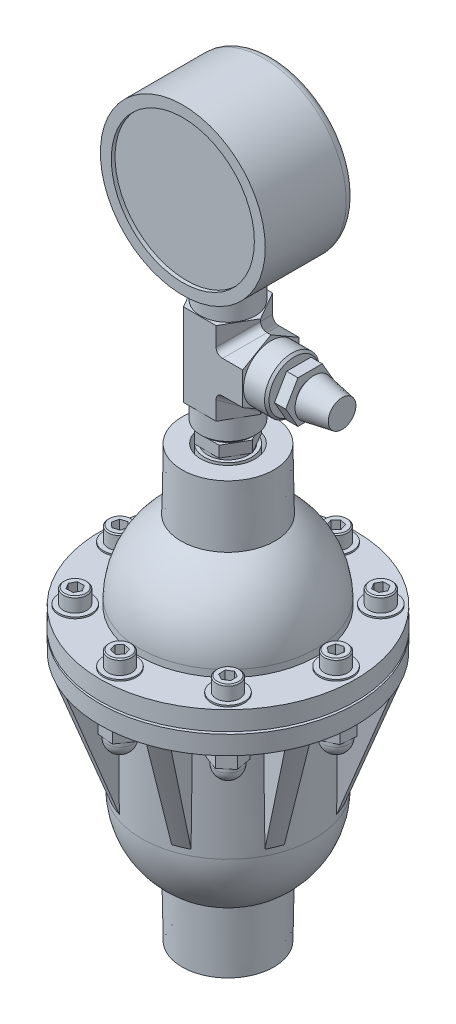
from build123d import *

# Parameters (mm, degrees)
SKETCH1_R                    = 43.2435
EXTRUDE1_DEPTH               = 6.35
EXTRUDE1_TAPER               = 1
SKETCH2_R                    = 29.972
EXTRUDE2_DEPTH               = 37.338
EXTRUDE2_TAPER               = 1
FILLET1_R                    = 29.21
SKETCH3_R                    = 15.494
EXTRUDE3_DEPTH               = 53.6702
EXTRUDE3_DRAFT               = 1
SKETCH4_R                    = 9.144
SKETCH4_R_2                  = 8.001
EXTRUDE4_DEPTH               = 16.637
EXTRUDE4_DRAFT               = -1
SKETCH7_R                    = 43.2435
EXTRUDE5_DEPTH               = 6.35
EXTRUDE5_DRAFT               = -1
SKETCH8_R                    = 32.4866
EXTRUDE6_DEPTH               = 6.35
SKETCH9_R                    = 29.972
EXTRUDE7_DEPTH               = 74.422
EXTRUDE7_DRAFT               = -1
FILLET3_R                    = 28.448
SKETCH14_R                   = 15.494
EXTRUDE9_DEPTH               = 97.917
EXTRUDE9_DRAFT               = -1
EXTRUDE10_DEPTH              = 38.1
EXTRUDE10_DRAFT              = -1
CIRPATTERN1_COPY_1_DEPTH     = 38.1
CIRPATTERN1_COPY_1_DRAFT     = -1
CIRPATTERN1_COPY_2_DEPTH     = 38.1
CIRPATTERN1_COPY_2_DRAFT     = -1
CIRPATTERN1_COPY_3_DEPTH     = 38.1
CIRPATTERN1_COPY_3_DRAFT     = -1
CIRPATTERN1_COPY_4_DEPTH     = 38.1
CIRPATTERN1_COPY_4_DRAFT     = -1
CIRPATTERN1_COPY_5_DEPTH     = 38.1
CIRPATTERN1_COPY_5_DRAFT     = -1
CIRPATTERN1_COPY_6_DEPTH     = 38.1
CIRPATTERN1_COPY_6_DRAFT     = -1
CIRPATTERN1_COPY_7_DEPTH     = 38.1
CIRPATTERN1_COPY_7_DRAFT     = -1
SKETCH19_R                   = 5.5626
EXTRUDE11_DEPTH              = 0.508
SKETCH20_R                   = 3.9624
EXTRUDE12_DEPTH              = 5.334
EXTRUDE13_DEPTH              = 3.175
CHAMFER1_SIZE                = 0.381
EXTRUDE14_START              = -0.508
SKETCH22_R                   = 5.5626
EXTRUDE14_DEPTH              = 0.508
EXTRUDE15_DEPTH              = 5.334
SKETCH24_R                   = 4.318
EXTRUDE16_DEPTH              = 10.922
FILLET4_R                    = 4.191
CIRPATTERN2_COUNT            = 8
CHAMFER1_OF_CIRPATTERN2_SIZE = 0.381
FILLET4_OF_CIRPATTERN2_R     = 4.191
SKETCH25_R                   = 6.858
BOSS_EXTRUDE1_DEPTH          = 132.334
SKETCH26_R                   = 27.813
BOSS_EXTRUDE2_DEPTH          = 15.24
BOSS_EXTRUDE5_DEPTH          = 3.81
SKETCH30_R                   = 9.271
BOSS_EXTRUDE6_DEPTH          = 43.18
BOSS_EXTRUDE8_DEPTH          = 27.94
BOSS_EXTRUDE9_DEPTH          = 14.986
SKETCH33_R                   = 9.271
BOSS_EXTRUDE10_DEPTH         = 14.986
SKETCH34_R                   = 6.858
BOSS_EXTRUDE11_DEPTH         = 3.81
BOSS_EXTRUDE12_DEPTH         = 3.81
SKETCH38_R                   = 4.7625
BOSS_EXTRUDE14_DEPTH         = 9.525
SKETCH39_R                   = 6.35
BOSS_EXTRUDE15_DEPTH         = 9.525
BOSS_EXTRUDE15_TAPER         = 10
SKETCH40_R                   = 24.13
CUT_EXTRUDE1_DEPTH           = 1.27
FILLET5_R                    = 2.54
FILLET6_R                    = 3.175
CHAMFER2_SIZE                = 0.762


with BuildPart() as part:
    # Sketch1 → Extrude1 (new body)
    with BuildSketch(Plane(origin=(0, 0, 0), x_dir=(1, 0, 0), z_dir=(0, 1, 0))):
        Circle(SKETCH1_R)
    extrude(amount=EXTRUDE1_DEPTH, taper=EXTRUDE1_TAPER)

    # Sketch2 → Extrude2 (add)
    with BuildSketch(Plane(origin=(0, 0, 0), x_dir=(1, 0, 0), z_dir=(0, 1, 0))):
        Circle(SKETCH2_R)
    extrude(amount=EXTRUDE2_DEPTH, taper=EXTRUDE2_TAPER)

    # Fillet1
    fillet1_edges = [part.edges().sort_by_distance(p)[0] for p in [
        (-29.320262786, 37.338, 0),
    ]]
    fillet(fillet1_edges, radius=FILLET1_R)


with BuildPart() as extrude3_tool:
    # Sketch3 → Extrude3 (with draft: the straight prism first)
    with BuildSketch(Plane(origin=(0, 53.6702, 0), x_dir=(-1, 0, 0), z_dir=(0, 1, 0))):
        Circle(SKETCH3_R)
    extrude(amount=-EXTRUDE3_DEPTH)
    # Extrude3: the draft: its side faces are tilted about the plane it starts from
    extrude3_sides = [extrude3_tool.faces().sort_by_distance(p)[0] for p in [
        (15.494, 26.8351, 0),
    ]]
    draft(extrude3_sides, Plane(origin=(0, 53.6702, 0), x_dir=(-1, 0, 0), z_dir=(0, 1, 0)), EXTRUDE3_DRAFT)


with BuildPart() as part_1:
    add(part.part)

    # Extrude3: add extrude3_tool
    add(extrude3_tool.part)


with BuildPart() as extrude4_tool:
    # Sketch4 → Extrude4 (with draft: the straight prism first)
    with BuildSketch(Plane(origin=(0, 53.6702, 0), x_dir=(-1, 0, 0), z_dir=(0, 1, 0))):
        Circle(SKETCH4_R)
        Circle(SKETCH4_R_2, mode=Mode.SUBTRACT)
    extrude(amount=-EXTRUDE4_DEPTH)
    # Extrude4: the draft: its side faces are tilted about the plane it starts from
    extrude4_sides = [extrude4_tool.faces().sort_by_distance(p)[0] for p in [
        (9.144, 45.3517, 0),
        (8.001, 45.3517, 0),
    ]]
    draft(extrude4_sides, Plane(origin=(0, 53.6702, 0), x_dir=(-1, 0, 0), z_dir=(0, 1, 0)), EXTRUDE4_DRAFT)


with BuildPart() as part_2:
    add(part_1.part)

    # Extrude4: cut by extrude4_tool
    add(extrude4_tool.part, mode=Mode.SUBTRACT)

    # Sketch5 → 1_4 NPT Tapped Hole1 (revolve, cut)
    with BuildSketch(Plane(origin=(0, 53.6702, 0), x_dir=(0, 0, 1), z_dir=(1, 0, 0))):
        Polygon((0, 0), (0, 20.360347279), (5.5626, 17.018), (5.5626, 9.906), (6.557984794, 9.906), (6.8545837, 0), align=None)
    revolve(axis=Axis((0, 60.0202, 0), (0, -1, 0)), mode=Mode.SUBTRACT)



with BuildPart() as body_2:
    # Sketch7 → Extrude5 (with draft: the straight prism first)
    with BuildSketch(Plane(origin=(0, -0.762, 0), x_dir=(-1, 0, 0), z_dir=(0, 1, 0))):
        Circle(SKETCH7_R)
    extrude(amount=-EXTRUDE5_DEPTH)
    # Extrude5: the draft: its side faces are tilted about the plane it starts from
    extrude5_sides = [body_2.faces().sort_by_distance(p)[0] for p in [
        (43.2435, -3.937, 0),
    ]]
    draft(extrude5_sides, Plane(origin=(0, -0.762, 0), x_dir=(-1, 0, 0), z_dir=(0, 1, 0)), EXTRUDE5_DRAFT)


with BuildPart() as part_3:
    add(part_2.part)

    add(body_2.part)  # Extrude6 merges body 2
    # Sketch8 → Extrude6 (add)
    with BuildSketch(Plane(origin=(0, -0.762, 0), x_dir=(-1, 0, 0), z_dir=(0, 1, 0))):
        with Locations(Location((0, 0, 0), (0, 0, 90))):
            Circle(SKETCH8_R)
    extrude(amount=EXTRUDE6_DEPTH)


with BuildPart() as extrude7_tool:
    # Sketch9 → Extrude7 (with draft: the straight prism first)
    with BuildSketch(Plane(origin=(0, -0.762, 0), x_dir=(-1, 0, 0), z_dir=(0, 1, 0))):
        Circle(SKETCH9_R)
    extrude(amount=-EXTRUDE7_DEPTH)
    # Extrude7: the draft: its side faces are tilted about the plane it starts from
    extrude7_sides = [extrude7_tool.faces().sort_by_distance(p)[0] for p in [
        (29.972, -37.973, 0),
    ]]
    draft(extrude7_sides, Plane(origin=(0, -0.762, 0), x_dir=(-1, 0, 0), z_dir=(0, 1, 0)), EXTRUDE7_DRAFT)


with BuildPart() as part_4:
    add(part_3.part)

    # Extrude7: add extrude7_tool
    add(extrude7_tool.part)

    # Fillet3
    fillet3_edges = [part_4.edges().sort_by_distance(p)[0] for p in [
        (28.672959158, -75.184, 0),
    ]]
    fillet(fillet3_edges, radius=FILLET3_R)


with BuildPart() as extrude9_tool:
    # Sketch14 → Extrude9 (with draft: the straight prism first)
    with BuildSketch(Plane(origin=(0, -91.567, 0), x_dir=(-1, 0, 0), z_dir=(0, 1, 0))):
        Circle(SKETCH14_R)
    extrude(amount=EXTRUDE9_DEPTH)
    # Extrude9: the draft: its side faces are tilted about the plane it starts from
    extrude9_sides = [extrude9_tool.faces().sort_by_distance(p)[0] for p in [
        (15.494, -42.6085, 0),
    ]]
    draft(extrude9_sides, Plane(origin=(0, -91.567, 0), x_dir=(-1, 0, 0), z_dir=(0, 1, 0)), EXTRUDE9_DRAFT)


with BuildPart() as part_5:
    add(part_4.part)

    # Extrude9: add extrude9_tool
    add(extrude9_tool.part)

    # Sketch15 → 1_2 NPT Tapped Hole2 (revolve, cut)
    with BuildSketch(Plane(origin=(0, -91.567, 0), x_dir=(0, 0, -1), z_dir=(1, 0, 0))):
        Polygon((0, 0), (0, 27.970543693), (8.9281, 22.606), (8.9281, 13.462), (10.261665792, 13.462), (10.6647361, 0), align=None)
    revolve(axis=Axis((0, -97.917, 0), (0, 1, 0)), mode=Mode.SUBTRACT)


with BuildPart() as extrude10_tool:
    # Sketch17 → Extrude10 (with draft: the straight prism first)
    with BuildSketch(Plane(origin=(0, -7.112, 0), x_dir=(-1, 0, 0), z_dir=(0, 1, 0))):
        with BuildLine():
            Line((-25.320914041, 7.051670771), (-22.916283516, 12.928830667))
            Line((-22.916283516, 12.928830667), (-38.628934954, 19.437223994))
            ThreePointArc((-38.628934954, 19.437223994), (-39.951784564, 16.548571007), (-41.058974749, 13.570588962))
            Line((-41.058974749, 13.570588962), (-25.320914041, 7.051670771))
        make_face()
    extrude(amount=-EXTRUDE10_DEPTH)
    # Extrude10: the draft: its side faces are tilted about the plane it starts from
    extrude10_sides = [extrude10_tool.faces().sort_by_distance(p)[0] for p in [
        (33.189944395, -26.162, 10.311129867),
        (24.118598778, -26.162, 9.990250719),
        (30.772609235, -26.162, 16.183027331),
        (39.951784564, -26.162, 16.548571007),
    ]]
    draft(extrude10_sides, Plane(origin=(0, -7.112, 0), x_dir=(-1, 0, 0), z_dir=(0, 1, 0)), EXTRUDE10_DRAFT)


with BuildPart() as part_6:
    add(part_5.part)

    # Extrude10: add extrude10_tool
    add(extrude10_tool.part)


with BuildPart() as cirpattern1_copy_1_tool:
    # CirPattern1 copy 1 sketch → CirPattern1 copy 1 (with draft: the straight prism first)
    with BuildSketch(Plane(origin=(0, -7.112, 0), x_dir=(-0.7071067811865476, 0, 0.7071067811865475), z_dir=(0, 1, 0))):
        with BuildLine():
            Line((-25.320914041, 7.051670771), (-22.916283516, 12.928830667))
            Line((-22.916283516, 12.928830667), (-38.628934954, 19.437223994))
            ThreePointArc((-38.628934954, 19.437223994), (-39.951784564, 16.548571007), (-41.058974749, 13.570588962))
            Line((-41.058974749, 13.570588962), (-25.320914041, 7.051670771))
        make_face()
    extrude(amount=-CIRPATTERN1_COPY_1_DEPTH)
    # CirPattern1 copy 1: the draft: its side faces are tilted about the plane it starts from
    cirpattern1_copy_1_sides = [cirpattern1_copy_1_tool.faces().sort_by_distance(p)[0] for p in [
        (30.7599046, -26.162, -16.177764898),
        (24.118598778, -26.162, -9.990250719),
        (33.202649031, -26.162, -10.316392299),
        (39.951784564, -26.162, -16.548571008),
    ]]
    draft(cirpattern1_copy_1_sides, Plane(origin=(0, -7.112, 0), x_dir=(-0.7071067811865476, 0, 0.7071067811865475), z_dir=(0, 1, 0)), CIRPATTERN1_COPY_1_DRAFT)


with BuildPart() as part_7:
    add(part_6.part)

    # CirPattern1 copy 1: add cirpattern1_copy_1_tool
    add(cirpattern1_copy_1_tool.part)


with BuildPart() as cirpattern1_copy_2_tool:
    # CirPattern1 copy 2 sketch → CirPattern1 copy 2 (with draft: the straight prism first)
    with BuildSketch(Plane.ZX.offset(-7.112)):
        with BuildLine():
            Line((-25.320914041, 7.051670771), (-22.916283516, 12.928830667))
            Line((-22.916283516, 12.928830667), (-38.628934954, 19.437223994))
            ThreePointArc((-38.628934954, 19.437223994), (-39.951784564, 16.548571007), (-41.058974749, 13.570588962))
            Line((-41.058974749, 13.570588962), (-25.320914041, 7.051670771))
        make_face()
    extrude(amount=-CIRPATTERN1_COPY_2_DEPTH)
    # CirPattern1 copy 2: the draft: its side faces are tilted about the plane it starts from
    cirpattern1_copy_2_sides = [cirpattern1_copy_2_tool.faces().sort_by_distance(p)[0] for p in [
        (10.311129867, -26.162, -33.189944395),
        (9.990250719, -26.162, -24.118598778),
        (16.183027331, -26.162, -30.772609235),
        (16.548571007, -26.162, -39.951784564),
    ]]
    draft(cirpattern1_copy_2_sides, Plane.ZX.offset(-7.112), CIRPATTERN1_COPY_2_DRAFT)


with BuildPart() as part_8:
    add(part_7.part)

    # CirPattern1 copy 2: add cirpattern1_copy_2_tool
    add(cirpattern1_copy_2_tool.part)


with BuildPart() as cirpattern1_copy_3_tool:
    # CirPattern1 copy 3 sketch → CirPattern1 copy 3 (with draft: the straight prism first)
    with BuildSketch(Plane(origin=(0, -7.112, 0), x_dir=(0.7071067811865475, 0, 0.7071067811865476), z_dir=(0, 1, 0))):
        with BuildLine():
            Line((-25.320914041, 7.051670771), (-22.916283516, 12.928830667))
            Line((-22.916283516, 12.928830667), (-38.628934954, 19.437223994))
            ThreePointArc((-38.628934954, 19.437223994), (-39.951784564, 16.548571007), (-41.058974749, 13.570588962))
            Line((-41.058974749, 13.570588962), (-25.320914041, 7.051670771))
        make_face()
    extrude(amount=-CIRPATTERN1_COPY_3_DEPTH)
    # CirPattern1 copy 3: the draft: its side faces are tilted about the plane it starts from
    cirpattern1_copy_3_sides = [cirpattern1_copy_3_tool.faces().sort_by_distance(p)[0] for p in [
        (-16.177764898, -26.162, -30.7599046),
        (-9.990250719, -26.162, -24.118598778),
        (-10.316392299, -26.162, -33.202649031),
        (-16.548571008, -26.162, -39.951784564),
    ]]
    draft(cirpattern1_copy_3_sides, Plane(origin=(0, -7.112, 0), x_dir=(0.7071067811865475, 0, 0.7071067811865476), z_dir=(0, 1, 0)), CIRPATTERN1_COPY_3_DRAFT)


with BuildPart() as part_9:
    add(part_8.part)

    # CirPattern1 copy 3: add cirpattern1_copy_3_tool
    add(cirpattern1_copy_3_tool.part)


with BuildPart() as cirpattern1_copy_4_tool:
    # CirPattern1 copy 4 sketch → CirPattern1 copy 4 (with draft: the straight prism first)
    with BuildSketch(Plane(origin=(0, -7.112, 0), x_dir=(1, 0, 0), z_dir=(0, 1, 0))):
        with BuildLine():
            Line((-25.320914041, 7.051670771), (-22.916283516, 12.928830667))
            Line((-22.916283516, 12.928830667), (-38.628934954, 19.437223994))
            ThreePointArc((-38.628934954, 19.437223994), (-39.951784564, 16.548571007), (-41.058974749, 13.570588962))
            Line((-41.058974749, 13.570588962), (-25.320914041, 7.051670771))
        make_face()
    extrude(amount=-CIRPATTERN1_COPY_4_DEPTH)
    # CirPattern1 copy 4: the draft: its side faces are tilted about the plane it starts from
    cirpattern1_copy_4_sides = [cirpattern1_copy_4_tool.faces().sort_by_distance(p)[0] for p in [
        (-33.189944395, -26.162, -10.311129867),
        (-24.118598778, -26.162, -9.990250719),
        (-30.772609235, -26.162, -16.183027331),
        (-39.951784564, -26.162, -16.548571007),
    ]]
    draft(cirpattern1_copy_4_sides, Plane(origin=(0, -7.112, 0), x_dir=(1, 0, 0), z_dir=(0, 1, 0)), CIRPATTERN1_COPY_4_DRAFT)


with BuildPart() as part_10:
    add(part_9.part)

    # CirPattern1 copy 4: add cirpattern1_copy_4_tool
    add(cirpattern1_copy_4_tool.part)


with BuildPart() as cirpattern1_copy_5_tool:
    # CirPattern1 copy 5 sketch → CirPattern1 copy 5 (with draft: the straight prism first)
    with BuildSketch(Plane(origin=(0, -7.112, 0), x_dir=(0.7071067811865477, 0, -0.7071067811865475), z_dir=(0, 1, 0))):
        with BuildLine():
            Line((-25.320914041, 7.051670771), (-22.916283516, 12.928830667))
            Line((-22.916283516, 12.928830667), (-38.628934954, 19.437223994))
            ThreePointArc((-38.628934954, 19.437223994), (-39.951784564, 16.548571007), (-41.058974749, 13.570588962))
            Line((-41.058974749, 13.570588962), (-25.320914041, 7.051670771))
        make_face()
    extrude(amount=-CIRPATTERN1_COPY_5_DEPTH)
    # CirPattern1 copy 5: the draft: its side faces are tilted about the plane it starts from
    cirpattern1_copy_5_sides = [cirpattern1_copy_5_tool.faces().sort_by_distance(p)[0] for p in [
        (-30.7599046, -26.162, 16.177764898),
        (-24.118598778, -26.162, 9.990250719),
        (-33.202649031, -26.162, 10.316392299),
        (-39.951784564, -26.162, 16.548571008),
    ]]
    draft(cirpattern1_copy_5_sides, Plane(origin=(0, -7.112, 0), x_dir=(0.7071067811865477, 0, -0.7071067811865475), z_dir=(0, 1, 0)), CIRPATTERN1_COPY_5_DRAFT)


with BuildPart() as part_11:
    add(part_10.part)

    # CirPattern1 copy 5: add cirpattern1_copy_5_tool
    add(cirpattern1_copy_5_tool.part)


with BuildPart() as cirpattern1_copy_6_tool:
    # CirPattern1 copy 6 sketch → CirPattern1 copy 6 (with draft: the straight prism first)
    with BuildSketch(Plane(origin=(0, -7.112, 0), x_dir=(0, 0, -1), z_dir=(0, 1, 0))):
        with BuildLine():
            Line((-25.320914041, 7.051670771), (-22.916283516, 12.928830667))
            Line((-22.916283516, 12.928830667), (-38.628934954, 19.437223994))
            ThreePointArc((-38.628934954, 19.437223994), (-39.951784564, 16.548571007), (-41.058974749, 13.570588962))
            Line((-41.058974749, 13.570588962), (-25.320914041, 7.051670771))
        make_face()
    extrude(amount=-CIRPATTERN1_COPY_6_DEPTH)
    # CirPattern1 copy 6: the draft: its side faces are tilted about the plane it starts from
    cirpattern1_copy_6_sides = [cirpattern1_copy_6_tool.faces().sort_by_distance(p)[0] for p in [
        (-10.311129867, -26.162, 33.189944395),
        (-9.990250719, -26.162, 24.118598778),
        (-16.183027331, -26.162, 30.772609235),
        (-16.548571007, -26.162, 39.951784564),
    ]]
    draft(cirpattern1_copy_6_sides, Plane(origin=(0, -7.112, 0), x_dir=(0, 0, -1), z_dir=(0, 1, 0)), CIRPATTERN1_COPY_6_DRAFT)


with BuildPart() as part_12:
    add(part_11.part)

    # CirPattern1 copy 6: add cirpattern1_copy_6_tool
    add(cirpattern1_copy_6_tool.part)


with BuildPart() as cirpattern1_copy_7_tool:
    # CirPattern1 copy 7 sketch → CirPattern1 copy 7 (with draft: the straight prism first)
    with BuildSketch(Plane(origin=(0, -7.112, 0), x_dir=(-0.7071067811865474, 0, -0.7071067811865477), z_dir=(0, 1, 0))):
        with BuildLine():
            Line((-25.320914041, 7.051670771), (-22.916283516, 12.928830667))
            Line((-22.916283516, 12.928830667), (-38.628934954, 19.437223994))
            ThreePointArc((-38.628934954, 19.437223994), (-39.951784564, 16.548571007), (-41.058974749, 13.570588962))
            Line((-41.058974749, 13.570588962), (-25.320914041, 7.051670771))
        make_face()
    extrude(amount=-CIRPATTERN1_COPY_7_DEPTH)
    # CirPattern1 copy 7: the draft: its side faces are tilted about the plane it starts from
    cirpattern1_copy_7_sides = [cirpattern1_copy_7_tool.faces().sort_by_distance(p)[0] for p in [
        (16.177764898, -26.162, 30.7599046),
        (9.990250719, -26.162, 24.118598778),
        (10.316392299, -26.162, 33.202649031),
        (16.548571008, -26.162, 39.951784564),
    ]]
    draft(cirpattern1_copy_7_sides, Plane(origin=(0, -7.112, 0), x_dir=(-0.7071067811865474, 0, -0.7071067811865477), z_dir=(0, 1, 0)), CIRPATTERN1_COPY_7_DRAFT)


with BuildPart() as part_13:
    add(part_12.part)

    # CirPattern1 copy 7: add cirpattern1_copy_7_tool
    add(cirpattern1_copy_7_tool.part)

    # Sketch18 → Cut-Revolve1 (revolve, cut)
    with BuildSketch(Plane(origin=(0, 0, 0), x_dir=(0, 0, -1), z_dir=(1, 0, 0))):
        Polygon((-43.132660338, -7.112), (-29.196122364, -45.212), (-32.828585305, -50.113717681), (-54.999171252, -50.113717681), (-46.726643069, -7.112), align=None)
    revolve(axis=Axis((0, 0, 0), (0, -1, 0)), mode=Mode.SUBTRACT)

    # Sketch19 → Extrude11 (add)
    with BuildSketch(Plane(origin=(0, 6.35, 0), x_dir=(-1, 0, 0), z_dir=(0, 1, 0))):
        with Locations(Location((-36.449, 0, 0), (0, 0, 90))):
            Circle(SKETCH19_R)
    extrude11 = extrude(amount=EXTRUDE11_DEPTH)

    # Sketch20 → Extrude12 (add)
    with BuildSketch(Plane(origin=(0, 6.35, 0), x_dir=(-1, 0, 0), z_dir=(0, 1, 0))):
        with Locations(Location((-36.449, 0, 0), (0, 0, 90))):
            Circle(SKETCH20_R)
    extrude12 = extrude(amount=EXTRUDE12_DEPTH)

    # Sketch21 → Extrude13 (cut)
    with BuildSketch(Plane(origin=(0, 11.684, 0), x_dir=(-1, 0, 0), z_dir=(0, 1, 0))):
        Polygon((-38.633720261, -0.678627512), (-36.953651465, -2.231337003), (-34.768931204, -1.55270949), (-34.264279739, 0.678627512), (-35.944348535, 2.231337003), (-38.129068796, 1.55270949), align=None)
    extrude13 = extrude(amount=-EXTRUDE13_DEPTH, mode=Mode.SUBTRACT)

    # Chamfer1
    chamfer1_edges = [part_13.edges().sort_by_distance(p)[0] for p in [
        (36.449, 11.684, -3.9624),
    ]]
    chamfer(chamfer1_edges, length=CHAMFER1_SIZE)

    # Sketch22 → Extrude14 (add)
    with BuildSketch(Plane(origin=(0, -7.112, 0), x_dir=(-1, 0, 0), z_dir=(0, 1, 0)).offset(EXTRUDE14_START)):
        with Locations(Location((-36.449, 0, 0), (0, 0, 90))):
            Circle(SKETCH22_R)
    extrude14 = extrude(amount=EXTRUDE14_DEPTH)

    # Sketch23 → Extrude15 (add)
    with BuildSketch(Plane(origin=(0, -7.112, 0), x_dir=(-1, 0, 0), z_dir=(0, 1, 0))):
        Polygon((-40.765731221, 3.039201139), (-41.239391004, -2.21879833), (-36.922659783, -5.257999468), (-32.132268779, -3.039201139), (-31.658608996, 2.21879833), (-35.975340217, 5.257999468), align=None)
    extrude15 = extrude(amount=-EXTRUDE15_DEPTH)

    # Sketch24 → Extrude16 (add)
    with BuildSketch(Plane(origin=(0, -7.112, 0), x_dir=(-1, 0, 0), z_dir=(0, 1, 0))):
        with Locations(Location((-36.449, 0, 0), (0, 0, 90))):
            Circle(SKETCH24_R)
    extrude16 = extrude(amount=-EXTRUDE16_DEPTH)

    # Fillet4
    fillet4_edges = [part_13.edges().sort_by_distance(p)[0] for p in [
        (36.449, -18.034, -4.318),
    ]]
    fillet(fillet4_edges, radius=FILLET4_R)

    # CirPattern2: Extrude11, Extrude12, Extrude13, Extrude14, Extrude15, Extrude16 ×8 about axis
    cirpattern2_axis = Axis((0, 0, 0), (0, 1, 0))
    add([extrude11.rotate(cirpattern2_axis, i * 360 / CIRPATTERN2_COUNT) for i in range(1, CIRPATTERN2_COUNT)])
    add([extrude12.rotate(cirpattern2_axis, i * 360 / CIRPATTERN2_COUNT) for i in range(1, CIRPATTERN2_COUNT)])
    add([extrude13.rotate(cirpattern2_axis, i * 360 / CIRPATTERN2_COUNT) for i in range(1, CIRPATTERN2_COUNT)], mode=Mode.SUBTRACT)
    add([extrude14.rotate(cirpattern2_axis, i * 360 / CIRPATTERN2_COUNT) for i in range(1, CIRPATTERN2_COUNT)])
    add([extrude15.rotate(cirpattern2_axis, i * 360 / CIRPATTERN2_COUNT) for i in range(1, CIRPATTERN2_COUNT)])
    add([extrude16.rotate(cirpattern2_axis, i * 360 / CIRPATTERN2_COUNT) for i in range(1, CIRPATTERN2_COUNT)])

    # Chamfer1 of CirPattern2
    chamfer1_of_cirpattern2_edges = [part_13.edges().sort_by_distance(p)[0] for p in [
        (22.971495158, 11.684, -28.575174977),
        (-3.9624, 11.684, -36.449),
        (-28.575174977, 11.684, -22.971495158),
        (-36.449, 11.684, 3.9624),
        (-22.971495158, 11.684, 28.575174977),
        (3.9624, 11.684, 36.449),
        (28.575174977, 11.684, 22.971495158),
    ]]
    chamfer(chamfer1_of_cirpattern2_edges, length=CHAMFER1_OF_CIRPATTERN2_SIZE)

    # Fillet4 of CirPattern2
    fillet4_of_cirpattern2_edges = [part_13.edges().sort_by_distance(p)[0] for p in [
        (22.720047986, -18.034, -28.826622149),
        (-4.318, -18.034, -36.449),
        (-28.826622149, -18.034, -22.720047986),
        (-36.449, -18.034, 4.318),
        (-22.720047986, -18.034, 28.826622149),
        (4.318, -18.034, 36.449),
        (28.826622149, -18.034, 22.720047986),
    ]]
    fillet(fillet4_of_cirpattern2_edges, radius=FILLET4_OF_CIRPATTERN2_R)

    # Sketch25 → Boss-Extrude1 (add)
    with BuildSketch(Plane(origin=(0, 0, 0), x_dir=(1, 0, 0), z_dir=(0, 1, 0))):
        with Locations(Location((0, 0, 0), (0, 0, 270))):
            Circle(SKETCH25_R)
    extrude(amount=BOSS_EXTRUDE1_DEPTH)

    # Sketch26 → Boss-Extrude2 (add, symmetric)
    with BuildSketch(Plane.XY):
        with Locations((0, 132.334)):
            Circle(SKETCH26_R)
    extrude(amount=BOSS_EXTRUDE2_DEPTH, both=True)

    # Sketch29 → Boss-Extrude5 (add)
    with BuildSketch(Plane(origin=(0, 54.9402, 0), x_dir=(-1, 0, 0), z_dir=(0, 1, 0))):
        Polygon((-8.212230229, 0), (-4.106115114, -7.112), (4.106115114, -7.112), (8.212230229, 0), (4.106115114, 7.112), (-4.106115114, 7.112), align=None)
    extrude(amount=BOSS_EXTRUDE5_DEPTH)

    # Sketch30 → Boss-Extrude6 (add)
    with BuildSketch(Plane(origin=(0, 60.0202, 0), x_dir=(-1, 0, 0), z_dir=(0, 1, 0))):
        with Locations(Location((0, 0, 0), (0, 0, 90))):
            Circle(SKETCH30_R)
    extrude(amount=BOSS_EXTRUDE6_DEPTH)

    # Sketch31 → Boss-Extrude8 (add)
    with BuildSketch(Plane(origin=(0, 67.6402, 0), x_dir=(-1, 0, 0), z_dir=(0, 1, 0))):
        Polygon((-10.998522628, 0), (-5.499261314, -9.525), (5.499261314, -9.525), (10.998522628, 0), (5.499261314, 9.525), (-5.499261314, 9.525), align=None)
    extrude(amount=BOSS_EXTRUDE8_DEPTH)

    # Sketch32 → Boss-Extrude9 (add)
    with BuildSketch(Plane(origin=(14.478, 0, 0), x_dir=(0, 0, -1), z_dir=(1, 0, 0))):
        Polygon((0, 92.608722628), (-9.525, 87.109461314), (-9.525, 76.110938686), (0, 70.611677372), (9.525, 76.110938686), (9.525, 87.109461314), align=None)
    extrude(amount=-BOSS_EXTRUDE9_DEPTH)

    # Sketch33 → Boss-Extrude10 (add)
    with BuildSketch(Plane(origin=(22.352, 0, 0), x_dir=(0, 0, -1), z_dir=(1, 0, 0))):
        with Locations((0, 81.6102)):
            Circle(SKETCH33_R)
    extrude(amount=-BOSS_EXTRUDE10_DEPTH)



with BuildPart() as body_2_2:
    # Sketch34 → Boss-Extrude11 (new body)
    with BuildSketch(Plane(origin=(27.686, 0, 0), x_dir=(0, 0, -1), z_dir=(1, 0, 0))):
        with Locations((0, 81.6102)):
            Circle(SKETCH34_R)
    extrude(amount=-BOSS_EXTRUDE11_DEPTH)

    # Sketch35 → Boss-Extrude12 (add)
    with BuildSketch(Plane(origin=(27.686, 0, 0), x_dir=(0, 0, -1), z_dir=(1, 0, 0))):
        Polygon((-8.212230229, 81.6102), (-4.106115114, 74.4982), (4.106115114, 74.4982), (8.212230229, 81.6102), (4.106115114, 88.7222), (-4.106115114, 88.7222), align=None)
    extrude(amount=-BOSS_EXTRUDE12_DEPTH)


with BuildPart() as part_14:
    add(part_13.part)

    add(body_2_2.part)  # Boss-Extrude14 merges body 2 2
    # Sketch38 → Boss-Extrude14 (add)
    with BuildSketch(Plane(origin=(28.956, 0, 0), x_dir=(0, 0, -1), z_dir=(1, 0, 0))):
        with Locations((0, 81.6102)):
            Circle(SKETCH38_R)
    extrude(amount=-BOSS_EXTRUDE14_DEPTH)

    # Sketch39 → Boss-Extrude15 (add)
    with BuildSketch(Plane(origin=(28.956, 0, 0), x_dir=(0, 0, -1), z_dir=(1, 0, 0))):
        with Locations((0, 81.6102)):
            Circle(SKETCH39_R)
    extrude(amount=BOSS_EXTRUDE15_DEPTH, taper=BOSS_EXTRUDE15_TAPER)

    # Sketch40 → Cut-Extrude1 (cut)
    with BuildSketch(Plane.XY.offset(15.24)):
        with Locations((0, 132.334)):
            Circle(SKETCH40_R)
    extrude(amount=-CUT_EXTRUDE1_DEPTH, mode=Mode.SUBTRACT)

    # Fillet5
    fillet5_edges = [part_14.edges().sort_by_distance(p)[0] for p in [
        (8.248891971, 89.859091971, -4.7625),
        (8.248891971, 73.361308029, -4.7625),
        (8.248891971, 73.361308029, 4.7625),
        (8.248891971, 89.859091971, 4.7625),
    ]]
    fillet(fillet5_edges, radius=FILLET5_R)

    # Fillet6
    fillet6_edges = [part_14.edges().sort_by_distance(p)[0] for p in [
        (-27.813, 132.334, -15.24),
    ]]
    fillet(fillet6_edges, radius=FILLET6_R)

    # Chamfer2
    chamfer2_edges = [part_14.edges().sort_by_distance(p)[0] for p in [
        (0, 103.2002, -9.271),
        (0, 60.0202, -9.271),
        (22.352, 81.6102, 9.271),
    ]]
    chamfer(chamfer2_edges, length=CHAMFER2_SIZE)


solid = part_14.part
